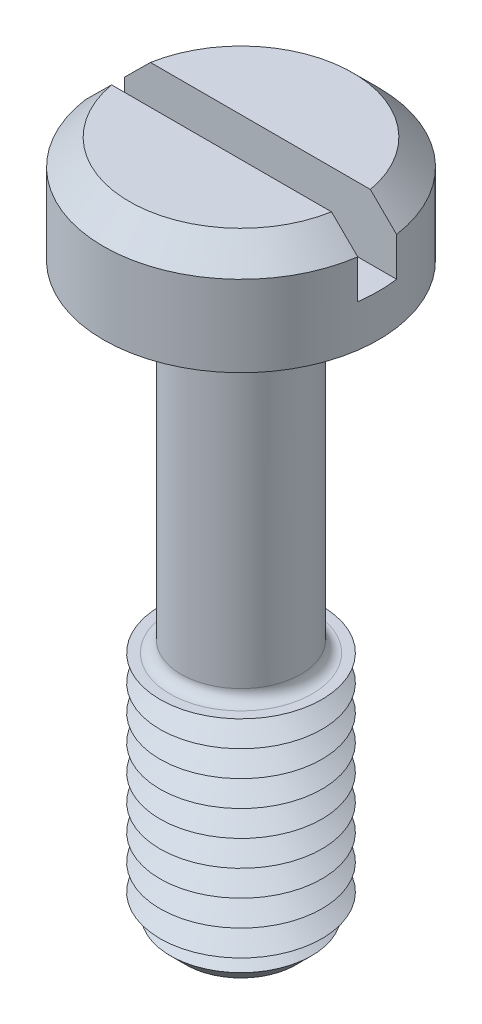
ISO-10303-21;
HEADER;
FILE_DESCRIPTION(('STEP AP214'),'2;1');
FILE_NAME('part.step','',(''),(''),'','','');
FILE_SCHEMA(('AUTOMOTIVE_DESIGN { 1 0 10303 214 1 1 1 1 }'));
ENDSEC;
DATA;
#1=APPLICATION_CONTEXT('core data for automotive mechanical design processes');
#2=APPLICATION_PROTOCOL_DEFINITION('international standard','automotive_design',2000,#1);
#3=PRODUCT_CONTEXT('',#1,'mechanical');
#4=PRODUCT('Part','Part','',(#3));
#5=PRODUCT_RELATED_PRODUCT_CATEGORY('part','',(#4));
#6=PRODUCT_DEFINITION_FORMATION('','',#4);
#7=PRODUCT_DEFINITION_CONTEXT('part definition',#1,'design');
#8=PRODUCT_DEFINITION('design','',#6,#7);
#9=PRODUCT_DEFINITION_SHAPE('','',#8);
#10=(LENGTH_UNIT() NAMED_UNIT(*) SI_UNIT(.MILLI.,.METRE.));
#11=(NAMED_UNIT(*) PLANE_ANGLE_UNIT() SI_UNIT($,.RADIAN.));
#12=(NAMED_UNIT(*) SI_UNIT($,.STERADIAN.) SOLID_ANGLE_UNIT());
#13=UNCERTAINTY_MEASURE_WITH_UNIT(LENGTH_MEASURE(1.E-05),#10,'distance_accuracy_value','');
#14=(GEOMETRIC_REPRESENTATION_CONTEXT(3) GLOBAL_UNCERTAINTY_ASSIGNED_CONTEXT((#13)) GLOBAL_UNIT_ASSIGNED_CONTEXT((#10,
#11,#12)) REPRESENTATION_CONTEXT('',''));
#15=CARTESIAN_POINT('',(0.,0.,0.));
#16=DIRECTION('',(0.,0.,1.));
#17=DIRECTION('',(1.,0.,0.));
#18=AXIS2_PLACEMENT_3D('',#15,#16,#17);
#19=CARTESIAN_POINT('',(0.,3.3,0.));
#20=DIRECTION('',(0.,1.,0.));
#21=DIRECTION('',(0.,0.,1.));
#22=AXIS2_PLACEMENT_3D('',#19,#20,#21);
#23=PLANE('',#22);
#24=DIRECTION('',(-1.,0.,0.));
#25=VECTOR('',#24,1.);
#26=CARTESIAN_POINT('',(4.25,3.3,-0.6));
#27=LINE('',#26,#25);
#28=CARTESIAN_POINT('',(3.39742549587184,3.3,-0.6));
#29=VERTEX_POINT('',#28);
#30=CARTESIAN_POINT('',(-3.39742549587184,3.3,-0.6));
#31=VERTEX_POINT('',#30);
#32=EDGE_CURVE('E110',#29,#31,#27,.T.);
#33=ORIENTED_EDGE('',*,*,#32,.F.);
#34=CARTESIAN_POINT('',(0.,3.3,0.));
#35=DIRECTION('',(0.,1.,0.));
#36=DIRECTION('',(0.,0.,1.));
#37=AXIS2_PLACEMENT_3D('',#34,#35,#36);
#38=CIRCLE('',#37,3.45);
#39=EDGE_CURVE('E113',#29,#31,#38,.T.);
#40=ORIENTED_EDGE('',*,*,#39,.T.);
#41=EDGE_LOOP('',(#33,#40));
#42=FACE_BOUND('',#41,.T.);
#43=ADVANCED_FACE('F39',(#42),#23,.T.);
#44=CARTESIAN_POINT('',(0.,3.3,0.));
#45=DIRECTION('',(0.,-1.,0.));
#46=DIRECTION('',(0.,0.,-1.));
#47=AXIS2_PLACEMENT_3D('',#44,#45,#46);
#48=CONICAL_SURFACE('',#47,3.45,0.785398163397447);
#49=CARTESIAN_POINT('',(9.35351408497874,-2.62273843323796,-0.6));
#50=CARTESIAN_POINT('',(9.03263557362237,-2.30252317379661,-0.6));
#51=CARTESIAN_POINT('',(8.71172811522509,-1.98233690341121,-0.6));
#52=CARTESIAN_POINT('',(8.06981262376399,-1.34205341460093,-0.6));
#53=CARTESIAN_POINT('',(7.74880458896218,-1.02195619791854,-0.6));
#54=CARTESIAN_POINT('',(7.10652460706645,-0.381761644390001,-0.6));
#55=CARTESIAN_POINT('',(6.78525260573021,-0.0616643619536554,-0.6));
#56=CARTESIAN_POINT('',(6.14251393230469,0.57832320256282,-0.6));
#57=CARTESIAN_POINT('',(5.82104726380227,0.898213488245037,-0.6));
#58=CARTESIAN_POINT('',(5.1719620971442,1.54347500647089,-0.6));
#59=CARTESIAN_POINT('',(4.84433778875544,1.86884039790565,-0.6));
#60=CARTESIAN_POINT('',(4.35244442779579,2.35644593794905,-0.6));
#61=CARTESIAN_POINT('',(4.18839924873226,2.51891187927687,-0.6));
#62=CARTESIAN_POINT('',(3.86009606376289,2.84362679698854,-0.6));
#63=CARTESIAN_POINT('',(3.69583805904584,3.00587577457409,-0.6));
#64=CARTESIAN_POINT('',(3.36705354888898,3.33001661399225,-0.6));
#65=CARTESIAN_POINT('',(3.20252712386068,3.49190855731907,-0.6));
#66=CARTESIAN_POINT('',(2.87298689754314,3.81520272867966,-0.6));
#67=CARTESIAN_POINT('',(2.70797308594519,3.97660494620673,-0.6));
#68=CARTESIAN_POINT('',(2.37716903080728,4.29858210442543,-0.6));
#69=CARTESIAN_POINT('',(2.21137886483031,4.45915712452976,-0.6));
#70=CARTESIAN_POINT('',(1.96157219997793,4.69884609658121,-0.6));
#71=CARTESIAN_POINT('',(1.87811785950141,4.77854546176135,-0.6));
#72=CARTESIAN_POINT('',(1.71066064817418,4.93736532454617,-0.6));
#73=CARTESIAN_POINT('',(1.62665778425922,5.01648582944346,-0.6));
#74=CARTESIAN_POINT('',(1.49655488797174,5.13773269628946,-0.6));
#75=CARTESIAN_POINT('',(1.45074972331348,5.18017521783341,-0.6));
#76=CARTESIAN_POINT('',(1.35882119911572,5.26471614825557,-0.6));
#77=CARTESIAN_POINT('',(1.31269783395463,5.30681455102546,-0.6));
#78=CARTESIAN_POINT('',(1.22008852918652,5.39050695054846,-0.6));
#79=CARTESIAN_POINT('',(1.17360305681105,5.43210146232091,-0.6));
#80=CARTESIAN_POINT('',(1.08007401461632,5.51465347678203,-0.6));
#81=CARTESIAN_POINT('',(1.03303046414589,5.55561100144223,-0.6));
#82=CARTESIAN_POINT('',(0.919047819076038,5.65299331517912,-0.6));
#83=CARTESIAN_POINT('',(0.851738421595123,5.7089924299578,-0.6));
#84=CARTESIAN_POINT('',(0.748806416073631,5.79068526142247,-0.6));
#85=CARTESIAN_POINT('',(0.714125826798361,5.8175621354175,-0.6));
#86=CARTESIAN_POINT('',(0.643915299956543,5.8701807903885,-0.6));
#87=CARTESIAN_POINT('',(0.608385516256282,5.89592277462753,-0.6));
#88=CARTESIAN_POINT('',(0.545162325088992,5.93955652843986,-0.6));
#89=CARTESIAN_POINT('',(0.517718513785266,5.95780799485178,-0.6));
#90=CARTESIAN_POINT('',(0.462025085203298,5.99303174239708,-0.6));
#91=CARTESIAN_POINT('',(0.433775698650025,6.01000438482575,-0.6));
#92=CARTESIAN_POINT('',(0.376341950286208,6.04213837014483,-0.6));
#93=CARTESIAN_POINT('',(0.347160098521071,6.05730412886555,-0.6));
#94=CARTESIAN_POINT('',(0.2876425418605,6.08513394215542,-0.6));
#95=CARTESIAN_POINT('',(0.25730803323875,6.0978005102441,-0.6));
#96=CARTESIAN_POINT('',(0.190863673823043,6.12124627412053,-0.6));
#97=CARTESIAN_POINT('',(0.154554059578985,6.13148571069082,-0.6));
#98=CARTESIAN_POINT('',(0.0807909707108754,6.14565404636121,-0.6));
#99=CARTESIAN_POINT('',(0.0433423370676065,6.14960664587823,-0.6));
#100=CARTESIAN_POINT('',(-0.0317987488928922,6.15033783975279,-0.6));
#101=CARTESIAN_POINT('',(-0.069491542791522,6.14708428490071,-0.6));
#102=CARTESIAN_POINT('',(-0.143790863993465,6.13410921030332,-0.6));
#103=CARTESIAN_POINT('',(-0.18039362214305,6.12436747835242,-0.6));
#104=CARTESIAN_POINT('',(-0.254098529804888,6.09939647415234,-0.6));
#105=CARTESIAN_POINT('',(-0.291094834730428,6.08386859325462,-0.6));
#106=CARTESIAN_POINT('',(-0.363408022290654,6.04924663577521,-0.6));
#107=CARTESIAN_POINT('',(-0.398721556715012,6.03014579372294,-0.6));
#108=CARTESIAN_POINT('',(-0.468234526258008,5.98944452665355,-0.6));
#109=CARTESIAN_POINT('',(-0.502422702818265,5.96782521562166,-0.6));
#110=CARTESIAN_POINT('',(-0.569689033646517,5.92300618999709,-0.6));
#111=CARTESIAN_POINT('',(-0.602768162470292,5.89980792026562,-0.6));
#112=CARTESIAN_POINT('',(-0.671148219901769,5.85008963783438,-0.6));
#113=CARTESIAN_POINT('',(-0.706369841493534,5.82346130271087,-0.6));
#114=CARTESIAN_POINT('',(-0.776087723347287,5.76926828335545,-0.6));
#115=CARTESIAN_POINT('',(-0.810583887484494,5.74170347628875,-0.6));
#116=CARTESIAN_POINT('',(-0.913286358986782,5.65798278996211,-0.6));
#117=CARTESIAN_POINT('',(-0.980673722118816,5.60082541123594,-0.6));
#118=CARTESIAN_POINT('',(-1.11424616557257,5.48490670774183,-0.6));
#119=CARTESIAN_POINT('',(-1.18042891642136,5.42614273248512,-0.6));
#120=CARTESIAN_POINT('',(-1.31191262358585,5.30767463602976,-0.6));
#121=CARTESIAN_POINT('',(-1.37721382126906,5.24797078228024,-0.6));
#122=CARTESIAN_POINT('',(-1.5070108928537,5.12812906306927,-0.6));
#123=CARTESIAN_POINT('',(-1.57150872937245,5.06799331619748,-0.6));
#124=CARTESIAN_POINT('',(-1.70009132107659,4.94727328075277,-0.6));
#125=CARTESIAN_POINT('',(-1.76417604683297,4.88668896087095,-0.6));
#126=CARTESIAN_POINT('',(-1.95584105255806,4.70458824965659,-0.6));
#127=CARTESIAN_POINT('',(-2.08296922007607,4.58259645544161,-0.6));
#128=CARTESIAN_POINT('',(-2.33599178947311,4.33840625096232,-0.6));
#129=CARTESIAN_POINT('',(-2.46188913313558,4.21621087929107,-0.6));
#130=CARTESIAN_POINT('',(-2.71323511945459,3.97135925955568,-0.6));
#131=CARTESIAN_POINT('',(-2.83868376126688,3.84870301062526,-0.6));
#132=CARTESIAN_POINT('',(-3.21459106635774,3.48027743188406,-0.6));
#133=CARTESIAN_POINT('',(-3.46460626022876,3.2340559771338,-0.6));
#134=CARTESIAN_POINT('',(-3.96413793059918,2.74090313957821,-0.6));
#135=CARTESIAN_POINT('',(-4.21365415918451,2.4939715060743,-0.6));
#136=CARTESIAN_POINT('',(-4.71232475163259,1.99974737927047,-0.6));
#137=CARTESIAN_POINT('',(-4.96147911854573,1.7524548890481,-0.6));
#138=CARTESIAN_POINT('',(-5.45958725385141,1.25761544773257,-0.6));
#139=CARTESIAN_POINT('',(-5.70854099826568,1.01006847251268,-0.6));
#140=CARTESIAN_POINT('',(-6.20629498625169,0.514819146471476,-0.6));
#141=CARTESIAN_POINT('',(-6.45509522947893,0.267116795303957,-0.6));
#142=CARTESIAN_POINT('',(-7.20128563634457,-0.476100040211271,-0.6));
#143=CARTESIAN_POINT('',(-7.69851620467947,-0.971774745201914,-0.6));
#144=CARTESIAN_POINT('',(-8.38865115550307,-1.66007026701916,-0.6));
#145=CARTESIAN_POINT('',(-8.58165346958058,-1.85259293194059,-0.6));
#146=CARTESIAN_POINT('',(-8.87112736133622,-2.14139225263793,-0.6));
#147=CARTESIAN_POINT('',(-8.96761014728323,-2.23765767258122,-0.6));
#148=CARTESIAN_POINT('',(-9.16056764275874,-2.43019387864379,-0.6));
#149=CARTESIAN_POINT('',(-9.25704235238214,-2.52646466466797,-0.6));
#150=CARTESIAN_POINT('',(-9.35351408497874,-2.62273843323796,-0.6));
#151=B_SPLINE_CURVE_WITH_KNOTS('',3,(#49,#50,#51,#52,#53,#54,#55,#56,#57,#58,#59,#60,#61,#62,
#63,#64,#65,#66,#67,#68,#69,#70,#71,#72,#73,#74,#75,#76,#77,#78,#79,#80,#81,#82,#83,#84,#85,#86,
#87,#88,#89,#90,#91,#92,#93,#94,#95,#96,#97,#98,#99,#100,#101,#102,#103,#104,#105,#106,#107,
#108,#109,#110,#111,#112,#113,#114,#115,#116,#117,#118,#119,#120,#121,#122,#123,#124,#125,#126,
#127,#128,#129,#130,#131,#132,#133,#134,#135,#136,#137,#138,#139,#140,#141,#142,#143,#144,#145,
#146,#147,#148,#149,#150),.UNSPECIFIED.,.F.,.F.,(4,2,2,2,2,2,2,2,2,2,2,2,2,2,2,2,2,2,2,2,2,2,2,
2,2,2,2,2,2,2,2,2,2,2,2,2,2,2,2,2,2,2,2,2,2,2,2,2,2,2,4),(0.,1.35996600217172,2.71995696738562,
4.08050889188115,5.44103646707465,6.82624457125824,7.51888721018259,8.21152599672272,
8.9039856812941,9.59646011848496,10.288866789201,10.635058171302,10.9812451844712,
11.1685812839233,11.3559207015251,11.5430489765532,11.7301707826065,11.9927784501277,
12.1243921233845,12.2559821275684,12.3548333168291,12.4536564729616,12.5522329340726,
12.6507097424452,12.763461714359,12.8757876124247,12.9886156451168,13.101796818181,
13.2218851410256,13.3422031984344,13.4634899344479,13.584667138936,13.7171086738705,
13.8495676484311,14.1146090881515,14.3801178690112,14.6455524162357,14.910099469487,
15.17466516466,15.7032346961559,16.2295761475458,16.7559185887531,17.8086237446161,
18.8617626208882,19.9148925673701,20.9681337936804,22.0213773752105,24.1276499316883,
24.9454725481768,25.3543534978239,25.7632286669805),.UNSPECIFIED.);
#152=CARTESIAN_POINT('',(4.20743389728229,2.49999999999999,-0.6));
#153=VERTEX_POINT('',#152);
#154=EDGE_CURVE('E268',#153,#29,#151,.T.);
#155=ORIENTED_EDGE('',*,*,#154,.F.);
#156=CARTESIAN_POINT('',(0.,2.5,0.));
#157=DIRECTION('',(0.,1.,0.));
#158=DIRECTION('',(0.,0.,1.));
#159=AXIS2_PLACEMENT_3D('',#156,#157,#158);
#160=CIRCLE('',#159,4.25);
#161=CARTESIAN_POINT('',(-4.20743389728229,2.49999999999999,-0.6));
#162=VERTEX_POINT('',#161);
#163=EDGE_CURVE('E128',#162,#153,#160,.F.);
#164=ORIENTED_EDGE('',*,*,#163,.F.);
#165=EDGE_CURVE('E102',#31,#162,#151,.T.);
#166=ORIENTED_EDGE('',*,*,#165,.F.);
#167=ORIENTED_EDGE('',*,*,#39,.F.);
#168=EDGE_LOOP('',(#155,#164,#166,#167));
#169=FACE_BOUND('',#168,.T.);
#170=ADVANCED_FACE('F230',(#169),#48,.T.);
#171=CARTESIAN_POINT('',(0.,-18.,0.));
#172=DIRECTION('',(0.,1.,0.));
#173=DIRECTION('',(0.,0.,1.));
#174=AXIS2_PLACEMENT_3D('',#171,#172,#173);
#175=CYLINDRICAL_SURFACE('',#174,1.85);
#176=CARTESIAN_POINT('',(0.,-10.15,0.));
#177=DIRECTION('',(0.,-1.,0.));
#178=DIRECTION('',(0.,0.,-1.));
#179=AXIS2_PLACEMENT_3D('',#176,#177,#178);
#180=CIRCLE('',#179,1.85);
#181=CARTESIAN_POINT('',(0.,-10.15,-1.85));
#182=VERTEX_POINT('',#181);
#183=EDGE_CURVE('E123',#182,#182,#180,.F.);
#184=ORIENTED_EDGE('',*,*,#183,.T.);
#185=EDGE_LOOP('',(#184));
#186=FACE_BOUND('',#185,.T.);
#187=CARTESIAN_POINT('',(0.,-0.35,0.));
#188=DIRECTION('',(0.,1.,0.));
#189=DIRECTION('',(0.,0.,1.));
#190=AXIS2_PLACEMENT_3D('',#187,#188,#189);
#191=CIRCLE('',#190,1.85);
#192=CARTESIAN_POINT('',(0.,-0.35,1.85));
#193=VERTEX_POINT('',#192);
#194=EDGE_CURVE('E382',#193,#193,#191,.F.);
#195=ORIENTED_EDGE('',*,*,#194,.T.);
#196=EDGE_LOOP('',(#195));
#197=FACE_BOUND('',#196,.T.);
#198=ADVANCED_FACE('F226',(#186,#197),#175,.T.);
#199=CARTESIAN_POINT('',(0.,3.3,0.));
#200=DIRECTION('',(0.,-1.,0.));
#201=DIRECTION('',(0.,0.,-1.));
#202=AXIS2_PLACEMENT_3D('',#199,#200,#201);
#203=CYLINDRICAL_SURFACE('',#202,4.25);
#204=ORIENTED_EDGE('',*,*,#163,.T.);
#205=DIRECTION('',(0.,-1.,0.));
#206=VECTOR('',#205,1.);
#207=CARTESIAN_POINT('',(4.20743389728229,3.3,-0.6));
#208=LINE('',#207,#206);
#209=CARTESIAN_POINT('',(4.20743389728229,1.3,-0.6));
#210=VERTEX_POINT('',#209);
#211=EDGE_CURVE('E64',#153,#210,#208,.T.);
#212=ORIENTED_EDGE('',*,*,#211,.T.);
#213=CARTESIAN_POINT('',(0.,1.3,0.));
#214=DIRECTION('',(0.,1.,0.));
#215=DIRECTION('',(0.,0.,1.));
#216=AXIS2_PLACEMENT_3D('',#213,#214,#215);
#217=CIRCLE('',#216,4.25);
#218=CARTESIAN_POINT('',(4.20743389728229,1.3,0.6));
#219=VERTEX_POINT('',#218);
#220=EDGE_CURVE('E11',#219,#210,#217,.T.);
#221=ORIENTED_EDGE('',*,*,#220,.F.);
#222=DIRECTION('',(0.,-1.,0.));
#223=VECTOR('',#222,1.);
#224=CARTESIAN_POINT('',(4.20743389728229,3.3,0.6));
#225=LINE('',#224,#223);
#226=CARTESIAN_POINT('',(4.20743389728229,2.49999999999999,0.6));
#227=VERTEX_POINT('',#226);
#228=EDGE_CURVE('E285',#219,#227,#225,.F.);
#229=ORIENTED_EDGE('',*,*,#228,.T.);
#230=CARTESIAN_POINT('',(-4.20743389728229,2.49999999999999,0.6));
#231=VERTEX_POINT('',#230);
#232=EDGE_CURVE('E120',#227,#231,#160,.F.);
#233=ORIENTED_EDGE('',*,*,#232,.T.);
#234=DIRECTION('',(0.,-1.,0.));
#235=VECTOR('',#234,1.);
#236=CARTESIAN_POINT('',(-4.20743389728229,3.3,0.6));
#237=LINE('',#236,#235);
#238=CARTESIAN_POINT('',(-4.20743389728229,1.3,0.6));
#239=VERTEX_POINT('',#238);
#240=EDGE_CURVE('E96',#231,#239,#237,.T.);
#241=ORIENTED_EDGE('',*,*,#240,.T.);
#242=CARTESIAN_POINT('',(-4.20743389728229,1.3,-0.6));
#243=VERTEX_POINT('',#242);
#244=EDGE_CURVE('E44',#243,#239,#217,.T.);
#245=ORIENTED_EDGE('',*,*,#244,.F.);
#246=DIRECTION('',(0.,-1.,0.));
#247=VECTOR('',#246,1.);
#248=CARTESIAN_POINT('',(-4.20743389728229,3.3,-0.6));
#249=LINE('',#248,#247);
#250=EDGE_CURVE('E289',#243,#162,#249,.F.);
#251=ORIENTED_EDGE('',*,*,#250,.T.);
#252=EDGE_LOOP('',(#204,#212,#221,#229,#233,#241,#245,#251));
#253=FACE_BOUND('',#252,.T.);
#254=CARTESIAN_POINT('',(0.,0.,0.));
#255=DIRECTION('',(0.,1.,0.));
#256=DIRECTION('',(0.,0.,1.));
#257=AXIS2_PLACEMENT_3D('',#254,#255,#256);
#258=CIRCLE('',#257,4.25);
#259=CARTESIAN_POINT('',(0.,0.,4.25));
#260=VERTEX_POINT('',#259);
#261=EDGE_CURVE('E367',#260,#260,#258,.T.);
#262=ORIENTED_EDGE('',*,*,#261,.T.);
#263=EDGE_LOOP('',(#262));
#264=FACE_BOUND('',#263,.T.);
#265=ADVANCED_FACE('F229',(#253,#264),#203,.T.);
#266=DIRECTION('',(1.,0.,0.));
#267=VECTOR('',#266,1.);
#268=CARTESIAN_POINT('',(4.25,3.3,0.6));
#269=LINE('',#268,#267);
#270=CARTESIAN_POINT('',(-3.39742549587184,3.3,0.6));
#271=VERTEX_POINT('',#270);
#272=CARTESIAN_POINT('',(3.39742549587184,3.3,0.6));
#273=VERTEX_POINT('',#272);
#274=EDGE_CURVE('E56',#271,#273,#269,.T.);
#275=ORIENTED_EDGE('',*,*,#274,.F.);
#276=EDGE_CURVE('E108',#271,#273,#38,.T.);
#277=ORIENTED_EDGE('',*,*,#276,.T.);
#278=EDGE_LOOP('',(#275,#277));
#279=FACE_BOUND('',#278,.T.);
#280=ADVANCED_FACE('F107',(#279),#23,.T.);
#281=CARTESIAN_POINT('',(0.,0.,0.));
#282=DIRECTION('',(0.,1.,0.));
#283=DIRECTION('',(0.,0.,1.));
#284=AXIS2_PLACEMENT_3D('',#281,#282,#283);
#285=PLANE('',#284);
#286=CARTESIAN_POINT('',(0.,0.,0.));
#287=DIRECTION('',(0.,1.,0.));
#288=DIRECTION('',(0.,0.,1.));
#289=AXIS2_PLACEMENT_3D('',#286,#287,#288);
#290=CIRCLE('',#289,2.2);
#291=CARTESIAN_POINT('',(0.,0.,2.2));
#292=VERTEX_POINT('',#291);
#293=EDGE_CURVE('E114',#292,#292,#290,.T.);
#294=ORIENTED_EDGE('',*,*,#293,.T.);
#295=EDGE_LOOP('',(#294));
#296=FACE_BOUND('',#295,.T.);
#297=ORIENTED_EDGE('',*,*,#261,.F.);
#298=EDGE_LOOP('',(#297));
#299=FACE_BOUND('',#298,.T.);
#300=ADVANCED_FACE('F220',(#296,#299),#285,.F.);
#301=CARTESIAN_POINT('',(0.,-10.5,0.));
#302=DIRECTION('',(0.,-1.,0.));
#303=DIRECTION('',(0.,0.,-1.));
#304=AXIS2_PLACEMENT_3D('',#301,#302,#303);
#305=PLANE('',#304);
#306=CARTESIAN_POINT('',(0.,-10.5,0.));
#307=DIRECTION('',(0.,-1.,0.));
#308=DIRECTION('',(0.,0.,-1.));
#309=AXIS2_PLACEMENT_3D('',#306,#307,#308);
#310=CIRCLE('',#309,2.2);
#311=CARTESIAN_POINT('',(0.,-10.5,-2.2));
#312=VERTEX_POINT('',#311);
#313=EDGE_CURVE('E375',#312,#312,#310,.T.);
#314=ORIENTED_EDGE('',*,*,#313,.T.);
#315=EDGE_LOOP('',(#314));
#316=FACE_BOUND('',#315,.T.);
#317=CARTESIAN_POINT('',(0.,-10.5,0.));
#318=DIRECTION('',(0.,1.,0.));
#319=DIRECTION('',(0.,0.,1.));
#320=AXIS2_PLACEMENT_3D('',#317,#318,#319);
#321=CIRCLE('',#320,2.5);
#322=CARTESIAN_POINT('',(0.,-10.5,2.5));
#323=VERTEX_POINT('',#322);
#324=EDGE_CURVE('E363',#323,#323,#321,.T.);
#325=ORIENTED_EDGE('',*,*,#324,.T.);
#326=EDGE_LOOP('',(#325));
#327=FACE_BOUND('',#326,.T.);
#328=ADVANCED_FACE('F216',(#316,#327),#305,.F.);
#329=CARTESIAN_POINT('',(0.,-10.9,0.));
#330=DIRECTION('',(0.,1.,0.));
#331=DIRECTION('',(0.,0.,1.));
#332=AXIS2_PLACEMENT_3D('',#329,#330,#331);
#333=CONICAL_SURFACE('',#332,1.80717967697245,1.0471975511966);
#334=ORIENTED_EDGE('',*,*,#324,.F.);
#335=EDGE_LOOP('',(#334));
#336=FACE_BOUND('',#335,.T.);
#337=CARTESIAN_POINT('',(0.,-10.9,0.));
#338=DIRECTION('',(0.,1.,0.));
#339=DIRECTION('',(0.,0.,1.));
#340=AXIS2_PLACEMENT_3D('',#337,#338,#339);
#341=CIRCLE('',#340,1.80717967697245);
#342=CARTESIAN_POINT('',(0.,-10.9,1.80717967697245));
#343=VERTEX_POINT('',#342);
#344=EDGE_CURVE('E359',#343,#343,#341,.T.);
#345=ORIENTED_EDGE('',*,*,#344,.T.);
#346=EDGE_LOOP('',(#345));
#347=FACE_BOUND('',#346,.T.);
#348=ADVANCED_FACE('F212',(#336,#347),#333,.T.);
#349=CARTESIAN_POINT('',(0.,-11.3,0.));
#350=DIRECTION('',(0.,-1.,0.));
#351=DIRECTION('',(0.,0.,-1.));
#352=AXIS2_PLACEMENT_3D('',#349,#350,#351);
#353=CONICAL_SURFACE('',#352,2.5,1.0471975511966);
#354=ORIENTED_EDGE('',*,*,#344,.F.);
#355=EDGE_LOOP('',(#354));
#356=FACE_BOUND('',#355,.T.);
#357=CARTESIAN_POINT('',(0.,-11.3,0.));
#358=DIRECTION('',(0.,1.,0.));
#359=DIRECTION('',(0.,0.,1.));
#360=AXIS2_PLACEMENT_3D('',#357,#358,#359);
#361=CIRCLE('',#360,2.5);
#362=CARTESIAN_POINT('',(0.,-11.3,2.5));
#363=VERTEX_POINT('',#362);
#364=EDGE_CURVE('E355',#363,#363,#361,.T.);
#365=ORIENTED_EDGE('',*,*,#364,.T.);
#366=EDGE_LOOP('',(#365));
#367=FACE_BOUND('',#366,.T.);
#368=ADVANCED_FACE('F208',(#356,#367),#353,.T.);
#369=CARTESIAN_POINT('',(0.,-11.7,0.));
#370=DIRECTION('',(0.,1.,0.));
#371=DIRECTION('',(0.,0.,1.));
#372=AXIS2_PLACEMENT_3D('',#369,#370,#371);
#373=CONICAL_SURFACE('',#372,1.80717967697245,1.0471975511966);
#374=ORIENTED_EDGE('',*,*,#364,.F.);
#375=EDGE_LOOP('',(#374));
#376=FACE_BOUND('',#375,.T.);
#377=CARTESIAN_POINT('',(0.,-11.7,0.));
#378=DIRECTION('',(0.,1.,0.));
#379=DIRECTION('',(0.,0.,1.));
#380=AXIS2_PLACEMENT_3D('',#377,#378,#379);
#381=CIRCLE('',#380,1.80717967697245);
#382=CARTESIAN_POINT('',(0.,-11.7,1.80717967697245));
#383=VERTEX_POINT('',#382);
#384=EDGE_CURVE('E352',#383,#383,#381,.T.);
#385=ORIENTED_EDGE('',*,*,#384,.T.);
#386=EDGE_LOOP('',(#385));
#387=FACE_BOUND('',#386,.T.);
#388=ADVANCED_FACE('F204',(#376,#387),#373,.T.);
#389=CARTESIAN_POINT('',(0.,-12.1,0.));
#390=DIRECTION('',(0.,-1.,0.));
#391=DIRECTION('',(0.,0.,-1.));
#392=AXIS2_PLACEMENT_3D('',#389,#390,#391);
#393=CONICAL_SURFACE('',#392,2.5,1.0471975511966);
#394=ORIENTED_EDGE('',*,*,#384,.F.);
#395=EDGE_LOOP('',(#394));
#396=FACE_BOUND('',#395,.T.);
#397=CARTESIAN_POINT('',(0.,-12.1,0.));
#398=DIRECTION('',(0.,1.,0.));
#399=DIRECTION('',(0.,0.,1.));
#400=AXIS2_PLACEMENT_3D('',#397,#398,#399);
#401=CIRCLE('',#400,2.5);
#402=CARTESIAN_POINT('',(0.,-12.1,2.5));
#403=VERTEX_POINT('',#402);
#404=EDGE_CURVE('E348',#403,#403,#401,.T.);
#405=ORIENTED_EDGE('',*,*,#404,.T.);
#406=EDGE_LOOP('',(#405));
#407=FACE_BOUND('',#406,.T.);
#408=ADVANCED_FACE('F200',(#396,#407),#393,.T.);
#409=CARTESIAN_POINT('',(0.,-12.5,0.));
#410=DIRECTION('',(0.,1.,0.));
#411=DIRECTION('',(0.,0.,1.));
#412=AXIS2_PLACEMENT_3D('',#409,#410,#411);
#413=CONICAL_SURFACE('',#412,1.80717967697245,1.0471975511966);
#414=ORIENTED_EDGE('',*,*,#404,.F.);
#415=EDGE_LOOP('',(#414));
#416=FACE_BOUND('',#415,.T.);
#417=CARTESIAN_POINT('',(0.,-12.5,0.));
#418=DIRECTION('',(0.,1.,0.));
#419=DIRECTION('',(0.,0.,1.));
#420=AXIS2_PLACEMENT_3D('',#417,#418,#419);
#421=CIRCLE('',#420,1.80717967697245);
#422=CARTESIAN_POINT('',(0.,-12.5,1.80717967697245));
#423=VERTEX_POINT('',#422);
#424=EDGE_CURVE('E344',#423,#423,#421,.T.);
#425=ORIENTED_EDGE('',*,*,#424,.T.);
#426=EDGE_LOOP('',(#425));
#427=FACE_BOUND('',#426,.T.);
#428=ADVANCED_FACE('F196',(#416,#427),#413,.T.);
#429=CARTESIAN_POINT('',(0.,-12.9,0.));
#430=DIRECTION('',(0.,-1.,0.));
#431=DIRECTION('',(0.,0.,-1.));
#432=AXIS2_PLACEMENT_3D('',#429,#430,#431);
#433=CONICAL_SURFACE('',#432,2.5,1.0471975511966);
#434=ORIENTED_EDGE('',*,*,#424,.F.);
#435=EDGE_LOOP('',(#434));
#436=FACE_BOUND('',#435,.T.);
#437=CARTESIAN_POINT('',(0.,-12.9,0.));
#438=DIRECTION('',(0.,1.,0.));
#439=DIRECTION('',(0.,0.,1.));
#440=AXIS2_PLACEMENT_3D('',#437,#438,#439);
#441=CIRCLE('',#440,2.5);
#442=CARTESIAN_POINT('',(0.,-12.9,2.5));
#443=VERTEX_POINT('',#442);
#444=EDGE_CURVE('E341',#443,#443,#441,.T.);
#445=ORIENTED_EDGE('',*,*,#444,.T.);
#446=EDGE_LOOP('',(#445));
#447=FACE_BOUND('',#446,.T.);
#448=ADVANCED_FACE('F192',(#436,#447),#433,.T.);
#449=CARTESIAN_POINT('',(0.,-13.3,0.));
#450=DIRECTION('',(0.,1.,0.));
#451=DIRECTION('',(0.,0.,1.));
#452=AXIS2_PLACEMENT_3D('',#449,#450,#451);
#453=CONICAL_SURFACE('',#452,1.80717967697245,1.0471975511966);
#454=ORIENTED_EDGE('',*,*,#444,.F.);
#455=EDGE_LOOP('',(#454));
#456=FACE_BOUND('',#455,.T.);
#457=CARTESIAN_POINT('',(0.,-13.3,0.));
#458=DIRECTION('',(0.,1.,0.));
#459=DIRECTION('',(0.,0.,1.));
#460=AXIS2_PLACEMENT_3D('',#457,#458,#459);
#461=CIRCLE('',#460,1.80717967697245);
#462=CARTESIAN_POINT('',(0.,-13.3,1.80717967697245));
#463=VERTEX_POINT('',#462);
#464=EDGE_CURVE('E337',#463,#463,#461,.T.);
#465=ORIENTED_EDGE('',*,*,#464,.T.);
#466=EDGE_LOOP('',(#465));
#467=FACE_BOUND('',#466,.T.);
#468=ADVANCED_FACE('F188',(#456,#467),#453,.T.);
#469=CARTESIAN_POINT('',(0.,-13.7,0.));
#470=DIRECTION('',(0.,-1.,0.));
#471=DIRECTION('',(0.,0.,-1.));
#472=AXIS2_PLACEMENT_3D('',#469,#470,#471);
#473=CONICAL_SURFACE('',#472,2.5,1.0471975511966);
#474=ORIENTED_EDGE('',*,*,#464,.F.);
#475=EDGE_LOOP('',(#474));
#476=FACE_BOUND('',#475,.T.);
#477=CARTESIAN_POINT('',(0.,-13.7,0.));
#478=DIRECTION('',(0.,1.,0.));
#479=DIRECTION('',(0.,0.,1.));
#480=AXIS2_PLACEMENT_3D('',#477,#478,#479);
#481=CIRCLE('',#480,2.5);
#482=CARTESIAN_POINT('',(0.,-13.7,2.5));
#483=VERTEX_POINT('',#482);
#484=EDGE_CURVE('E333',#483,#483,#481,.T.);
#485=ORIENTED_EDGE('',*,*,#484,.T.);
#486=EDGE_LOOP('',(#485));
#487=FACE_BOUND('',#486,.T.);
#488=ADVANCED_FACE('F184',(#476,#487),#473,.T.);
#489=CARTESIAN_POINT('',(0.,-14.1,0.));
#490=DIRECTION('',(0.,1.,0.));
#491=DIRECTION('',(0.,0.,1.));
#492=AXIS2_PLACEMENT_3D('',#489,#490,#491);
#493=CONICAL_SURFACE('',#492,1.80717967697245,1.0471975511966);
#494=ORIENTED_EDGE('',*,*,#484,.F.);
#495=EDGE_LOOP('',(#494));
#496=FACE_BOUND('',#495,.T.);
#497=CARTESIAN_POINT('',(0.,-14.1,0.));
#498=DIRECTION('',(0.,1.,0.));
#499=DIRECTION('',(0.,0.,1.));
#500=AXIS2_PLACEMENT_3D('',#497,#498,#499);
#501=CIRCLE('',#500,1.80717967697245);
#502=CARTESIAN_POINT('',(0.,-14.1,1.80717967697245));
#503=VERTEX_POINT('',#502);
#504=EDGE_CURVE('E330',#503,#503,#501,.T.);
#505=ORIENTED_EDGE('',*,*,#504,.T.);
#506=EDGE_LOOP('',(#505));
#507=FACE_BOUND('',#506,.T.);
#508=ADVANCED_FACE('F180',(#496,#507),#493,.T.);
#509=CARTESIAN_POINT('',(0.,-14.5,0.));
#510=DIRECTION('',(0.,-1.,0.));
#511=DIRECTION('',(0.,0.,-1.));
#512=AXIS2_PLACEMENT_3D('',#509,#510,#511);
#513=CONICAL_SURFACE('',#512,2.5,1.0471975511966);
#514=ORIENTED_EDGE('',*,*,#504,.F.);
#515=EDGE_LOOP('',(#514));
#516=FACE_BOUND('',#515,.T.);
#517=CARTESIAN_POINT('',(0.,-14.5,0.));
#518=DIRECTION('',(0.,1.,0.));
#519=DIRECTION('',(0.,0.,1.));
#520=AXIS2_PLACEMENT_3D('',#517,#518,#519);
#521=CIRCLE('',#520,2.5);
#522=CARTESIAN_POINT('',(0.,-14.5,2.5));
#523=VERTEX_POINT('',#522);
#524=EDGE_CURVE('E326',#523,#523,#521,.T.);
#525=ORIENTED_EDGE('',*,*,#524,.T.);
#526=EDGE_LOOP('',(#525));
#527=FACE_BOUND('',#526,.T.);
#528=ADVANCED_FACE('F176',(#516,#527),#513,.T.);
#529=CARTESIAN_POINT('',(0.,-14.9,0.));
#530=DIRECTION('',(0.,1.,0.));
#531=DIRECTION('',(0.,0.,1.));
#532=AXIS2_PLACEMENT_3D('',#529,#530,#531);
#533=CONICAL_SURFACE('',#532,1.80717967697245,1.0471975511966);
#534=ORIENTED_EDGE('',*,*,#524,.F.);
#535=EDGE_LOOP('',(#534));
#536=FACE_BOUND('',#535,.T.);
#537=CARTESIAN_POINT('',(0.,-14.9,0.));
#538=DIRECTION('',(0.,1.,0.));
#539=DIRECTION('',(0.,0.,1.));
#540=AXIS2_PLACEMENT_3D('',#537,#538,#539);
#541=CIRCLE('',#540,1.80717967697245);
#542=CARTESIAN_POINT('',(0.,-14.9,1.80717967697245));
#543=VERTEX_POINT('',#542);
#544=EDGE_CURVE('E322',#543,#543,#541,.T.);
#545=ORIENTED_EDGE('',*,*,#544,.T.);
#546=EDGE_LOOP('',(#545));
#547=FACE_BOUND('',#546,.T.);
#548=ADVANCED_FACE('F172',(#536,#547),#533,.T.);
#549=CARTESIAN_POINT('',(0.,-15.3,0.));
#550=DIRECTION('',(0.,-1.,0.));
#551=DIRECTION('',(0.,0.,-1.));
#552=AXIS2_PLACEMENT_3D('',#549,#550,#551);
#553=CONICAL_SURFACE('',#552,2.5,1.0471975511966);
#554=ORIENTED_EDGE('',*,*,#544,.F.);
#555=EDGE_LOOP('',(#554));
#556=FACE_BOUND('',#555,.T.);
#557=CARTESIAN_POINT('',(0.,-15.3,0.));
#558=DIRECTION('',(0.,1.,0.));
#559=DIRECTION('',(0.,0.,1.));
#560=AXIS2_PLACEMENT_3D('',#557,#558,#559);
#561=CIRCLE('',#560,2.5);
#562=CARTESIAN_POINT('',(0.,-15.3,2.5));
#563=VERTEX_POINT('',#562);
#564=EDGE_CURVE('E318',#563,#563,#561,.T.);
#565=ORIENTED_EDGE('',*,*,#564,.T.);
#566=EDGE_LOOP('',(#565));
#567=FACE_BOUND('',#566,.T.);
#568=ADVANCED_FACE('F168',(#556,#567),#553,.T.);
#569=CARTESIAN_POINT('',(0.,-15.7,0.));
#570=DIRECTION('',(0.,1.,0.));
#571=DIRECTION('',(0.,0.,1.));
#572=AXIS2_PLACEMENT_3D('',#569,#570,#571);
#573=CONICAL_SURFACE('',#572,1.80717967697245,1.0471975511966);
#574=ORIENTED_EDGE('',*,*,#564,.F.);
#575=EDGE_LOOP('',(#574));
#576=FACE_BOUND('',#575,.T.);
#577=CARTESIAN_POINT('',(0.,-15.7,0.));
#578=DIRECTION('',(0.,1.,0.));
#579=DIRECTION('',(0.,0.,1.));
#580=AXIS2_PLACEMENT_3D('',#577,#578,#579);
#581=CIRCLE('',#580,1.80717967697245);
#582=CARTESIAN_POINT('',(0.,-15.7,1.80717967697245));
#583=VERTEX_POINT('',#582);
#584=EDGE_CURVE('E314',#583,#583,#581,.T.);
#585=ORIENTED_EDGE('',*,*,#584,.T.);
#586=EDGE_LOOP('',(#585));
#587=FACE_BOUND('',#586,.T.);
#588=ADVANCED_FACE('F164',(#576,#587),#573,.T.);
#589=CARTESIAN_POINT('',(0.,-16.1,0.));
#590=DIRECTION('',(0.,-1.,0.));
#591=DIRECTION('',(0.,0.,-1.));
#592=AXIS2_PLACEMENT_3D('',#589,#590,#591);
#593=CONICAL_SURFACE('',#592,2.5,1.0471975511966);
#594=ORIENTED_EDGE('',*,*,#584,.F.);
#595=EDGE_LOOP('',(#594));
#596=FACE_BOUND('',#595,.T.);
#597=CARTESIAN_POINT('',(0.,-16.1,0.));
#598=DIRECTION('',(0.,1.,0.));
#599=DIRECTION('',(0.,0.,1.));
#600=AXIS2_PLACEMENT_3D('',#597,#598,#599);
#601=CIRCLE('',#600,2.5);
#602=CARTESIAN_POINT('',(0.,-16.1,2.5));
#603=VERTEX_POINT('',#602);
#604=EDGE_CURVE('E310',#603,#603,#601,.T.);
#605=ORIENTED_EDGE('',*,*,#604,.T.);
#606=EDGE_LOOP('',(#605));
#607=FACE_BOUND('',#606,.T.);
#608=ADVANCED_FACE('F160',(#596,#607),#593,.T.);
#609=CARTESIAN_POINT('',(0.,-16.5,0.));
#610=DIRECTION('',(0.,1.,0.));
#611=DIRECTION('',(0.,0.,1.));
#612=AXIS2_PLACEMENT_3D('',#609,#610,#611);
#613=CONICAL_SURFACE('',#612,1.80717967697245,1.0471975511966);
#614=ORIENTED_EDGE('',*,*,#604,.F.);
#615=EDGE_LOOP('',(#614));
#616=FACE_BOUND('',#615,.T.);
#617=CARTESIAN_POINT('',(0.,-16.5,0.));
#618=DIRECTION('',(0.,1.,0.));
#619=DIRECTION('',(0.,0.,1.));
#620=AXIS2_PLACEMENT_3D('',#617,#618,#619);
#621=CIRCLE('',#620,1.80717967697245);
#622=CARTESIAN_POINT('',(0.,-16.5,1.80717967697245));
#623=VERTEX_POINT('',#622);
#624=EDGE_CURVE('E307',#623,#623,#621,.T.);
#625=ORIENTED_EDGE('',*,*,#624,.T.);
#626=EDGE_LOOP('',(#625));
#627=FACE_BOUND('',#626,.T.);
#628=ADVANCED_FACE('F156',(#616,#627),#613,.T.);
#629=CARTESIAN_POINT('',(0.,-16.9,0.));
#630=DIRECTION('',(0.,-1.,0.));
#631=DIRECTION('',(0.,0.,-1.));
#632=AXIS2_PLACEMENT_3D('',#629,#630,#631);
#633=CONICAL_SURFACE('',#632,2.5,1.0471975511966);
#634=ORIENTED_EDGE('',*,*,#624,.F.);
#635=EDGE_LOOP('',(#634));
#636=FACE_BOUND('',#635,.T.);
#637=CARTESIAN_POINT('',(0.,-16.9,0.));
#638=DIRECTION('',(0.,1.,0.));
#639=DIRECTION('',(0.,0.,1.));
#640=AXIS2_PLACEMENT_3D('',#637,#638,#639);
#641=CIRCLE('',#640,2.5);
#642=CARTESIAN_POINT('',(0.,-16.9,2.5));
#643=VERTEX_POINT('',#642);
#644=EDGE_CURVE('E303',#643,#643,#641,.T.);
#645=ORIENTED_EDGE('',*,*,#644,.T.);
#646=EDGE_LOOP('',(#645));
#647=FACE_BOUND('',#646,.T.);
#648=ADVANCED_FACE('F152',(#636,#647),#633,.T.);
#649=CARTESIAN_POINT('',(0.,-17.3,0.));
#650=DIRECTION('',(0.,1.,0.));
#651=DIRECTION('',(0.,0.,1.));
#652=AXIS2_PLACEMENT_3D('',#649,#650,#651);
#653=CONICAL_SURFACE('',#652,1.80717967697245,1.0471975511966);
#654=ORIENTED_EDGE('',*,*,#644,.F.);
#655=EDGE_LOOP('',(#654));
#656=FACE_BOUND('',#655,.T.);
#657=CARTESIAN_POINT('',(0.,-17.3,0.));
#658=DIRECTION('',(0.,1.,0.));
#659=DIRECTION('',(0.,0.,1.));
#660=AXIS2_PLACEMENT_3D('',#657,#658,#659);
#661=CIRCLE('',#660,1.80717967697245);
#662=CARTESIAN_POINT('',(0.,-17.3,1.80717967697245));
#663=VERTEX_POINT('',#662);
#664=EDGE_CURVE('E299',#663,#663,#661,.T.);
#665=ORIENTED_EDGE('',*,*,#664,.T.);
#666=EDGE_LOOP('',(#665));
#667=FACE_BOUND('',#666,.T.);
#668=ADVANCED_FACE('F148',(#656,#667),#653,.T.);
#669=CARTESIAN_POINT('',(0.,-17.7,0.));
#670=DIRECTION('',(0.,-1.,0.));
#671=DIRECTION('',(0.,0.,-1.));
#672=AXIS2_PLACEMENT_3D('',#669,#670,#671);
#673=CONICAL_SURFACE('',#672,2.5,1.0471975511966);
#674=CARTESIAN_POINT('',(0.,-17.5169872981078,0.));
#675=DIRECTION('',(0.,-1.,0.));
#676=DIRECTION('',(0.,0.,-1.));
#677=AXIS2_PLACEMENT_3D('',#674,#675,#676);
#678=CIRCLE('',#677,2.18301270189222);
#679=CARTESIAN_POINT('',(0.,-17.5169872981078,-2.18301270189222));
#680=VERTEX_POINT('',#679);
#681=EDGE_CURVE('E306',#680,#680,#678,.F.);
#682=ORIENTED_EDGE('',*,*,#681,.T.);
#683=EDGE_LOOP('',(#682));
#684=FACE_BOUND('',#683,.T.);
#685=ORIENTED_EDGE('',*,*,#664,.F.);
#686=EDGE_LOOP('',(#685));
#687=FACE_BOUND('',#686,.T.);
#688=ADVANCED_FACE('F144',(#684,#687),#673,.T.);
#689=CARTESIAN_POINT('',(0.,-18.,0.));
#690=DIRECTION('',(0.,-1.,0.));
#691=DIRECTION('',(0.,0.,-1.));
#692=AXIS2_PLACEMENT_3D('',#689,#690,#691);
#693=PLANE('',#692);
#694=CARTESIAN_POINT('',(0.,-18.,0.));
#695=DIRECTION('',(0.,-1.,0.));
#696=DIRECTION('',(0.,0.,-1.));
#697=AXIS2_PLACEMENT_3D('',#694,#695,#696);
#698=CIRCLE('',#697,1.7);
#699=CARTESIAN_POINT('',(0.,-18.,-1.7));
#700=VERTEX_POINT('',#699);
#701=EDGE_CURVE('E371',#700,#700,#698,.T.);
#702=ORIENTED_EDGE('',*,*,#701,.T.);
#703=EDGE_LOOP('',(#702));
#704=FACE_BOUND('',#703,.T.);
#705=ADVANCED_FACE('F147',(#704),#693,.T.);
#706=CARTESIAN_POINT('',(0.,-18.,0.));
#707=DIRECTION('',(0.,1.,0.));
#708=DIRECTION('',(0.,0.,1.));
#709=AXIS2_PLACEMENT_3D('',#706,#707,#708);
#710=CONICAL_SURFACE('',#709,1.7,0.785398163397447);
#711=ORIENTED_EDGE('',*,*,#681,.F.);
#712=EDGE_LOOP('',(#711));
#713=FACE_BOUND('',#712,.T.);
#714=ORIENTED_EDGE('',*,*,#701,.F.);
#715=EDGE_LOOP('',(#714));
#716=FACE_BOUND('',#715,.T.);
#717=ADVANCED_FACE('F224',(#713,#716),#710,.T.);
#718=CARTESIAN_POINT('',(0.,-10.15,0.));
#719=DIRECTION('',(0.,-1.,0.));
#720=DIRECTION('',(0.,0.,-1.));
#721=AXIS2_PLACEMENT_3D('',#718,#719,#720);
#722=TOROIDAL_SURFACE('',#721,2.2,0.35);
#723=ORIENTED_EDGE('',*,*,#183,.F.);
#724=EDGE_LOOP('',(#723));
#725=FACE_BOUND('',#724,.T.);
#726=ORIENTED_EDGE('',*,*,#313,.F.);
#727=EDGE_LOOP('',(#726));
#728=FACE_BOUND('',#727,.T.);
#729=ADVANCED_FACE('F242',(#725,#728),#722,.F.);
#730=CARTESIAN_POINT('',(0.,-0.35,0.));
#731=DIRECTION('',(0.,1.,0.));
#732=DIRECTION('',(0.,0.,1.));
#733=AXIS2_PLACEMENT_3D('',#730,#731,#732);
#734=TOROIDAL_SURFACE('',#733,2.2,0.35);
#735=ORIENTED_EDGE('',*,*,#293,.F.);
#736=EDGE_LOOP('',(#735));
#737=FACE_BOUND('',#736,.T.);
#738=ORIENTED_EDGE('',*,*,#194,.F.);
#739=EDGE_LOOP('',(#738));
#740=FACE_BOUND('',#739,.T.);
#741=ADVANCED_FACE('F245',(#737,#740),#734,.F.);
#742=CARTESIAN_POINT('',(-9.35351408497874,-2.62273843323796,0.6));
#743=CARTESIAN_POINT('',(-9.03263557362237,-2.30252317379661,0.6));
#744=CARTESIAN_POINT('',(-8.71172811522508,-1.98233690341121,0.6));
#745=CARTESIAN_POINT('',(-8.06981262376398,-1.34205341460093,0.6));
#746=CARTESIAN_POINT('',(-7.74880458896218,-1.02195619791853,0.6));
#747=CARTESIAN_POINT('',(-7.10652460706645,-0.381761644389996,0.6));
#748=CARTESIAN_POINT('',(-6.7852526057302,-0.0616643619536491,0.6));
#749=CARTESIAN_POINT('',(-6.14251393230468,0.578323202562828,0.6));
#750=CARTESIAN_POINT('',(-5.82104726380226,0.898213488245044,0.6));
#751=CARTESIAN_POINT('',(-5.17196209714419,1.54347500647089,0.6));
#752=CARTESIAN_POINT('',(-4.84433778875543,1.86884039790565,0.6));
#753=CARTESIAN_POINT('',(-4.35244442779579,2.35644593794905,0.6));
#754=CARTESIAN_POINT('',(-4.18839924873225,2.51891187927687,0.6));
#755=CARTESIAN_POINT('',(-3.86009606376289,2.84362679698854,0.6));
#756=CARTESIAN_POINT('',(-3.69583805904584,3.0058757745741,0.6));
#757=CARTESIAN_POINT('',(-3.36705354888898,3.33001661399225,0.6));
#758=CARTESIAN_POINT('',(-3.20252712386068,3.49190855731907,0.6));
#759=CARTESIAN_POINT('',(-2.87298689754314,3.81520272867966,0.6));
#760=CARTESIAN_POINT('',(-2.70797308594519,3.97660494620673,0.6));
#761=CARTESIAN_POINT('',(-2.37716903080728,4.29858210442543,0.6));
#762=CARTESIAN_POINT('',(-2.21137886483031,4.45915712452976,0.6));
#763=CARTESIAN_POINT('',(-1.96157219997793,4.69884609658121,0.6));
#764=CARTESIAN_POINT('',(-1.87811785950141,4.77854546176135,0.6));
#765=CARTESIAN_POINT('',(-1.71066064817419,4.93736532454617,0.6));
#766=CARTESIAN_POINT('',(-1.62665778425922,5.01648582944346,0.6));
#767=CARTESIAN_POINT('',(-1.49655488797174,5.13773269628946,0.6));
#768=CARTESIAN_POINT('',(-1.45074972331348,5.1801752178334,0.6));
#769=CARTESIAN_POINT('',(-1.35882119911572,5.26471614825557,0.6));
#770=CARTESIAN_POINT('',(-1.31269783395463,5.30681455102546,0.6));
#771=CARTESIAN_POINT('',(-1.22008852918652,5.39050695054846,0.6));
#772=CARTESIAN_POINT('',(-1.17360305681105,5.43210146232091,0.6));
#773=CARTESIAN_POINT('',(-1.08007401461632,5.51465347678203,0.6));
#774=CARTESIAN_POINT('',(-1.03303046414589,5.55561100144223,0.6));
#775=CARTESIAN_POINT('',(-0.919047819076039,5.65299331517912,0.6));
#776=CARTESIAN_POINT('',(-0.851738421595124,5.7089924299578,0.6));
#777=CARTESIAN_POINT('',(-0.748806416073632,5.79068526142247,0.6));
#778=CARTESIAN_POINT('',(-0.714125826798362,5.81756213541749,0.6));
#779=CARTESIAN_POINT('',(-0.643915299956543,5.8701807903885,0.6));
#780=CARTESIAN_POINT('',(-0.608385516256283,5.89592277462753,0.6));
#781=CARTESIAN_POINT('',(-0.545162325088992,5.93955652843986,0.6));
#782=CARTESIAN_POINT('',(-0.517718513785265,5.95780799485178,0.6));
#783=CARTESIAN_POINT('',(-0.462025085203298,5.99303174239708,0.6));
#784=CARTESIAN_POINT('',(-0.433775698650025,6.01000438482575,0.6));
#785=CARTESIAN_POINT('',(-0.376341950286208,6.04213837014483,0.6));
#786=CARTESIAN_POINT('',(-0.34716009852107,6.05730412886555,0.6));
#787=CARTESIAN_POINT('',(-0.287642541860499,6.08513394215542,0.6));
#788=CARTESIAN_POINT('',(-0.257308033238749,6.0978005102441,0.6));
#789=CARTESIAN_POINT('',(-0.190863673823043,6.12124627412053,0.6));
#790=CARTESIAN_POINT('',(-0.154554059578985,6.13148571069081,0.6));
#791=CARTESIAN_POINT('',(-0.0807909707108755,6.14565404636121,0.6));
#792=CARTESIAN_POINT('',(-0.0433423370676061,6.14960664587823,0.6));
#793=CARTESIAN_POINT('',(0.031798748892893,6.15033783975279,0.6));
#794=CARTESIAN_POINT('',(0.0694915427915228,6.14708428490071,0.6));
#795=CARTESIAN_POINT('',(0.143790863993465,6.13410921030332,0.6));
#796=CARTESIAN_POINT('',(0.180393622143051,6.12436747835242,0.6));
#797=CARTESIAN_POINT('',(0.254098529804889,6.09939647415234,0.6));
#798=CARTESIAN_POINT('',(0.29109483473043,6.08386859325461,0.6));
#799=CARTESIAN_POINT('',(0.363408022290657,6.04924663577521,0.6));
#800=CARTESIAN_POINT('',(0.398721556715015,6.03014579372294,0.6));
#801=CARTESIAN_POINT('',(0.46823452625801,5.98944452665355,0.6));
#802=CARTESIAN_POINT('',(0.502422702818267,5.96782521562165,0.6));
#803=CARTESIAN_POINT('',(0.569689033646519,5.92300618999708,0.6));
#804=CARTESIAN_POINT('',(0.602768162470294,5.89980792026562,0.6));
#805=CARTESIAN_POINT('',(0.671148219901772,5.85008963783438,0.6));
#806=CARTESIAN_POINT('',(0.706369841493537,5.82346130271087,0.6));
#807=CARTESIAN_POINT('',(0.776087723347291,5.76926828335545,0.6));
#808=CARTESIAN_POINT('',(0.810583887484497,5.74170347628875,0.6));
#809=CARTESIAN_POINT('',(0.913286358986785,5.65798278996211,0.6));
#810=CARTESIAN_POINT('',(0.980673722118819,5.60082541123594,0.6));
#811=CARTESIAN_POINT('',(1.11424616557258,5.48490670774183,0.6));
#812=CARTESIAN_POINT('',(1.18042891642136,5.42614273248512,0.6));
#813=CARTESIAN_POINT('',(1.31191262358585,5.30767463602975,0.6));
#814=CARTESIAN_POINT('',(1.37721382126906,5.24797078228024,0.6));
#815=CARTESIAN_POINT('',(1.5070108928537,5.12812906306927,0.6));
#816=CARTESIAN_POINT('',(1.57150872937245,5.06799331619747,0.6));
#817=CARTESIAN_POINT('',(1.70009132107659,4.94727328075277,0.6));
#818=CARTESIAN_POINT('',(1.76417604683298,4.88668896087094,0.6));
#819=CARTESIAN_POINT('',(1.95584105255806,4.70458824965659,0.6));
#820=CARTESIAN_POINT('',(2.08296922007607,4.58259645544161,0.6));
#821=CARTESIAN_POINT('',(2.33599178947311,4.33840625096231,0.6));
#822=CARTESIAN_POINT('',(2.46188913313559,4.21621087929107,0.6));
#823=CARTESIAN_POINT('',(2.7132351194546,3.97135925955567,0.6));
#824=CARTESIAN_POINT('',(2.83868376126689,3.84870301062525,0.6));
#825=CARTESIAN_POINT('',(3.21459106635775,3.48027743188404,0.6));
#826=CARTESIAN_POINT('',(3.46460626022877,3.23405597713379,0.6));
#827=CARTESIAN_POINT('',(3.96413793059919,2.7409031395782,0.6));
#828=CARTESIAN_POINT('',(4.21365415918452,2.49397150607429,0.6));
#829=CARTESIAN_POINT('',(4.7123247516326,1.99974737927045,0.6));
#830=CARTESIAN_POINT('',(4.96147911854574,1.75245488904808,0.6));
#831=CARTESIAN_POINT('',(5.45958725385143,1.25761544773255,0.6));
#832=CARTESIAN_POINT('',(5.7085409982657,1.01006847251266,0.6));
#833=CARTESIAN_POINT('',(6.2062949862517,0.514819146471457,0.6));
#834=CARTESIAN_POINT('',(6.45509522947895,0.267116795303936,0.6));
#835=CARTESIAN_POINT('',(7.20128563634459,-0.476100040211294,0.6));
#836=CARTESIAN_POINT('',(7.6985162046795,-0.971774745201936,0.6));
#837=CARTESIAN_POINT('',(8.38865115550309,-1.66007026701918,0.6));
#838=CARTESIAN_POINT('',(8.5816534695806,-1.8525929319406,0.6));
#839=CARTESIAN_POINT('',(8.87112736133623,-2.14139225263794,0.6));
#840=CARTESIAN_POINT('',(8.96761014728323,-2.23765767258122,0.6));
#841=CARTESIAN_POINT('',(9.16056764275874,-2.43019387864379,0.6));
#842=CARTESIAN_POINT('',(9.25704235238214,-2.52646466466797,0.6));
#843=CARTESIAN_POINT('',(9.35351408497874,-2.62273843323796,0.6));
#844=B_SPLINE_CURVE_WITH_KNOTS('',3,(#742,#743,#744,#745,#746,#747,#748,#749,#750,#751,#752,
#753,#754,#755,#756,#757,#758,#759,#760,#761,#762,#763,#764,#765,#766,#767,#768,#769,#770,#771,
#772,#773,#774,#775,#776,#777,#778,#779,#780,#781,#782,#783,#784,#785,#786,#787,#788,#789,#790,
#791,#792,#793,#794,#795,#796,#797,#798,#799,#800,#801,#802,#803,#804,#805,#806,#807,#808,#809,
#810,#811,#812,#813,#814,#815,#816,#817,#818,#819,#820,#821,#822,#823,#824,#825,#826,#827,#828,
#829,#830,#831,#832,#833,#834,#835,#836,#837,#838,#839,#840,#841,#842,#843),.UNSPECIFIED.,.F.,
.F.,(4,2,2,2,2,2,2,2,2,2,2,2,2,2,2,2,2,2,2,2,2,2,2,2,2,2,2,2,2,2,2,2,2,2,2,2,2,2,2,2,2,2,2,2,2,
2,2,2,2,2,4),(0.,1.35996600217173,2.71995696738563,4.08050889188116,5.44103646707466,
6.82624457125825,7.51888721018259,8.21152599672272,8.9039856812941,9.59646011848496,
10.288866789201,10.635058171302,10.9812451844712,11.1685812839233,11.3559207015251,
11.5430489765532,11.7301707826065,11.9927784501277,12.1243921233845,12.2559821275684,
12.3548333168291,12.4536564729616,12.5522329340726,12.6507097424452,12.763461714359,
12.8757876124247,12.9886156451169,13.101796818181,13.2218851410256,13.3422031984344,
13.4634899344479,13.584667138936,13.7171086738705,13.8495676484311,14.1146090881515,
14.3801178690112,14.6455524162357,14.910099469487,15.17466516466,15.7032346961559,
16.2295761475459,16.7559185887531,17.8086237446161,18.8617626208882,19.9148925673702,
20.9681337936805,22.0213773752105,24.1276499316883,24.9454725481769,25.3543534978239,
25.7632286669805),.UNSPECIFIED.);
#845=EDGE_CURVE('E92',#231,#271,#844,.T.);
#846=ORIENTED_EDGE('',*,*,#845,.F.);
#847=ORIENTED_EDGE('',*,*,#232,.F.);
#848=EDGE_CURVE('E103',#273,#227,#844,.T.);
#849=ORIENTED_EDGE('',*,*,#848,.F.);
#850=ORIENTED_EDGE('',*,*,#276,.F.);
#851=EDGE_LOOP('',(#846,#847,#849,#850));
#852=FACE_BOUND('',#851,.T.);
#853=ADVANCED_FACE('F41',(#852),#48,.T.);
#854=CARTESIAN_POINT('',(0.,1.3,0.));
#855=DIRECTION('',(0.,1.,0.));
#856=DIRECTION('',(0.,0.,1.));
#857=AXIS2_PLACEMENT_3D('',#854,#855,#856);
#858=PLANE('',#857);
#859=DIRECTION('',(1.,0.,0.));
#860=VECTOR('',#859,1.);
#861=CARTESIAN_POINT('',(4.25,1.3,0.6));
#862=LINE('',#861,#860);
#863=EDGE_CURVE('E265',#239,#219,#862,.T.);
#864=ORIENTED_EDGE('',*,*,#863,.T.);
#865=ORIENTED_EDGE('',*,*,#220,.T.);
#866=DIRECTION('',(-1.,0.,0.));
#867=VECTOR('',#866,1.);
#868=CARTESIAN_POINT('',(4.25,1.3,-0.6));
#869=LINE('',#868,#867);
#870=EDGE_CURVE('E282',#210,#243,#869,.T.);
#871=ORIENTED_EDGE('',*,*,#870,.T.);
#872=ORIENTED_EDGE('',*,*,#244,.T.);
#873=EDGE_LOOP('',(#864,#865,#871,#872));
#874=FACE_BOUND('',#873,.T.);
#875=ADVANCED_FACE('F252',(#874),#858,.T.);
#876=CARTESIAN_POINT('',(4.25,1.3,-0.6));
#877=DIRECTION('',(0.,0.,-1.));
#878=DIRECTION('',(-1.,0.,0.));
#879=AXIS2_PLACEMENT_3D('',#876,#877,#878);
#880=PLANE('',#879);
#881=ORIENTED_EDGE('',*,*,#154,.T.);
#882=ORIENTED_EDGE('',*,*,#32,.T.);
#883=ORIENTED_EDGE('',*,*,#165,.T.);
#884=ORIENTED_EDGE('',*,*,#250,.F.);
#885=ORIENTED_EDGE('',*,*,#870,.F.);
#886=ORIENTED_EDGE('',*,*,#211,.F.);
#887=EDGE_LOOP('',(#881,#882,#883,#884,#885,#886));
#888=FACE_BOUND('',#887,.T.);
#889=ADVANCED_FACE('F141',(#888),#880,.F.);
#890=CARTESIAN_POINT('',(4.25,1.3,0.6));
#891=DIRECTION('',(0.,0.,1.));
#892=DIRECTION('',(1.,0.,0.));
#893=AXIS2_PLACEMENT_3D('',#890,#891,#892);
#894=PLANE('',#893);
#895=ORIENTED_EDGE('',*,*,#845,.T.);
#896=ORIENTED_EDGE('',*,*,#274,.T.);
#897=ORIENTED_EDGE('',*,*,#848,.T.);
#898=ORIENTED_EDGE('',*,*,#228,.F.);
#899=ORIENTED_EDGE('',*,*,#863,.F.);
#900=ORIENTED_EDGE('',*,*,#240,.F.);
#901=EDGE_LOOP('',(#895,#896,#897,#898,#899,#900));
#902=FACE_BOUND('',#901,.T.);
#903=ADVANCED_FACE('F93',(#902),#894,.F.);
#904=CLOSED_SHELL('',(#43,#170,#198,#265,#280,#300,#328,#348,#368,#388,#408,#428,#448,#468,#488,
#508,#528,#548,#568,#588,#608,#628,#648,#668,#688,#705,#717,#729,#741,#853,#875,#889,#903));
#905=MANIFOLD_SOLID_BREP('B2',#904);
#906=ADVANCED_BREP_SHAPE_REPRESENTATION('',(#18,#905),#14);
#907=SHAPE_DEFINITION_REPRESENTATION(#9,#906);
ENDSEC;
END-ISO-10303-21;
